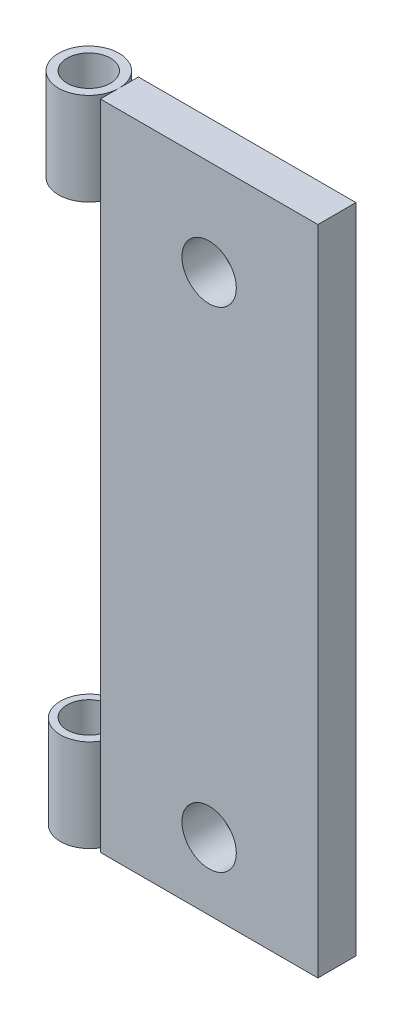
ISO-10303-21;
HEADER;
FILE_DESCRIPTION(('STEP AP214'),'2;1');
FILE_NAME('part.step','',(''),(''),'','','');
FILE_SCHEMA(('AUTOMOTIVE_DESIGN { 1 0 10303 214 1 1 1 1 }'));
ENDSEC;
DATA;
#1=APPLICATION_CONTEXT('core data for automotive mechanical design processes');
#2=APPLICATION_PROTOCOL_DEFINITION('international standard','automotive_design',2000,#1);
#3=PRODUCT_CONTEXT('',#1,'mechanical');
#4=PRODUCT('Part','Part','',(#3));
#5=PRODUCT_RELATED_PRODUCT_CATEGORY('part','',(#4));
#6=PRODUCT_DEFINITION_FORMATION('','',#4);
#7=PRODUCT_DEFINITION_CONTEXT('part definition',#1,'design');
#8=PRODUCT_DEFINITION('design','',#6,#7);
#9=PRODUCT_DEFINITION_SHAPE('','',#8);
#10=(LENGTH_UNIT() NAMED_UNIT(*) SI_UNIT(.MILLI.,.METRE.));
#11=(NAMED_UNIT(*) PLANE_ANGLE_UNIT() SI_UNIT($,.RADIAN.));
#12=(NAMED_UNIT(*) SI_UNIT($,.STERADIAN.) SOLID_ANGLE_UNIT());
#13=UNCERTAINTY_MEASURE_WITH_UNIT(LENGTH_MEASURE(1.E-05),#10,'distance_accuracy_value','');
#14=(GEOMETRIC_REPRESENTATION_CONTEXT(3) GLOBAL_UNCERTAINTY_ASSIGNED_CONTEXT((#13)) GLOBAL_UNIT_ASSIGNED_CONTEXT((#10,
#11,#12)) REPRESENTATION_CONTEXT('',''));
#15=CARTESIAN_POINT('',(0.,0.,0.));
#16=DIRECTION('',(0.,0.,1.));
#17=DIRECTION('',(1.,0.,0.));
#18=AXIS2_PLACEMENT_3D('',#15,#16,#17);
#19=CARTESIAN_POINT('',(-25.3853328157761,-43.,3.56421296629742));
#20=DIRECTION('',(0.,-1.,0.));
#21=DIRECTION('',(0.,0.,-1.));
#22=AXIS2_PLACEMENT_3D('',#19,#20,#21);
#23=CYLINDRICAL_SURFACE('',#22,5.38533281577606);
#24=CARTESIAN_POINT('',(-25.3853328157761,-43.,3.56421296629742));
#25=DIRECTION('',(0.,-1.,0.));
#26=DIRECTION('',(0.,0.,-1.));
#27=AXIS2_PLACEMENT_3D('',#24,#25,#26);
#28=CIRCLE('',#27,5.38533281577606);
#29=CARTESIAN_POINT('',(-25.3853328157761,-43.,-1.82111984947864));
#30=VERTEX_POINT('',#29);
#31=EDGE_CURVE('E11',#30,#30,#28,.T.);
#32=ORIENTED_EDGE('',*,*,#31,.T.);
#33=EDGE_LOOP('',(#32));
#34=FACE_BOUND('',#33,.T.);
#35=CARTESIAN_POINT('',(-25.3853328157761,-60.,3.56421296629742));
#36=DIRECTION('',(0.,-1.,0.));
#37=DIRECTION('',(0.,0.,-1.));
#38=AXIS2_PLACEMENT_3D('',#35,#36,#37);
#39=CIRCLE('',#38,5.38533281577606);
#40=CARTESIAN_POINT('',(-25.3853328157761,-60.,-1.82111984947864));
#41=VERTEX_POINT('',#40);
#42=EDGE_CURVE('E43',#41,#41,#39,.T.);
#43=ORIENTED_EDGE('',*,*,#42,.F.);
#44=EDGE_LOOP('',(#43));
#45=FACE_BOUND('',#44,.T.);
#46=ADVANCED_FACE('F40',(#34,#45),#23,.T.);
#47=CARTESIAN_POINT('',(-25.3853328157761,-43.,3.56421296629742));
#48=DIRECTION('',(0.,-1.,0.));
#49=DIRECTION('',(0.,0.,-1.));
#50=AXIS2_PLACEMENT_3D('',#47,#48,#49);
#51=PLANE('',#50);
#52=CARTESIAN_POINT('',(-25.5621825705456,-43.,3.56421296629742));
#53=DIRECTION('',(0.,1.,0.));
#54=DIRECTION('',(0.,0.,1.));
#55=AXIS2_PLACEMENT_3D('',#52,#53,#54);
#56=CIRCLE('',#55,4.00000000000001);
#57=CARTESIAN_POINT('',(-25.5621825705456,-43.,7.56421296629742));
#58=VERTEX_POINT('',#57);
#59=EDGE_CURVE('E52',#58,#58,#56,.T.);
#60=ORIENTED_EDGE('',*,*,#59,.F.);
#61=EDGE_LOOP('',(#60));
#62=FACE_BOUND('',#61,.T.);
#63=ORIENTED_EDGE('',*,*,#31,.F.);
#64=EDGE_LOOP('',(#63));
#65=FACE_BOUND('',#64,.T.);
#66=ADVANCED_FACE('F67',(#62,#65),#51,.F.);
#67=CARTESIAN_POINT('',(-25.3853328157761,-60.,3.56421296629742));
#68=DIRECTION('',(0.,-1.,0.));
#69=DIRECTION('',(0.,0.,-1.));
#70=AXIS2_PLACEMENT_3D('',#67,#68,#69);
#71=PLANE('',#70);
#72=CARTESIAN_POINT('',(-25.5621825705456,-60.,3.56421296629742));
#73=DIRECTION('',(0.,1.,0.));
#74=DIRECTION('',(0.,0.,1.));
#75=AXIS2_PLACEMENT_3D('',#72,#73,#74);
#76=CIRCLE('',#75,4.00000000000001);
#77=CARTESIAN_POINT('',(-25.5621825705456,-60.,7.56421296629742));
#78=VERTEX_POINT('',#77);
#79=EDGE_CURVE('E50',#78,#78,#76,.T.);
#80=ORIENTED_EDGE('',*,*,#79,.T.);
#81=EDGE_LOOP('',(#80));
#82=FACE_BOUND('',#81,.T.);
#83=ORIENTED_EDGE('',*,*,#42,.T.);
#84=EDGE_LOOP('',(#83));
#85=FACE_BOUND('',#84,.T.);
#86=ADVANCED_FACE('F58',(#82,#85),#71,.T.);
#87=CARTESIAN_POINT('',(-25.5621825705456,-60.,3.56421296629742));
#88=DIRECTION('',(0.,1.,0.));
#89=DIRECTION('',(0.,0.,1.));
#90=AXIS2_PLACEMENT_3D('',#87,#88,#89);
#91=CYLINDRICAL_SURFACE('',#90,4.00000000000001);
#92=ORIENTED_EDGE('',*,*,#79,.F.);
#93=EDGE_LOOP('',(#92));
#94=FACE_BOUND('',#93,.T.);
#95=ORIENTED_EDGE('',*,*,#59,.T.);
#96=EDGE_LOOP('',(#95));
#97=FACE_BOUND('',#96,.T.);
#98=ADVANCED_FACE('F61',(#94,#97),#91,.F.);
#99=CLOSED_SHELL('',(#46,#66,#86,#98));
#100=MANIFOLD_SOLID_BREP('B2',#99);
#101=CARTESIAN_POINT('',(-25.5621825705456,43.,3.56421296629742));
#102=DIRECTION('',(0.,1.,0.));
#103=DIRECTION('',(0.,0.,1.));
#104=AXIS2_PLACEMENT_3D('',#101,#102,#103);
#105=CYLINDRICAL_SURFACE('',#104,5.56218257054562);
#106=CARTESIAN_POINT('',(-25.5621825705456,43.,3.56421296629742));
#107=DIRECTION('',(0.,1.,0.));
#108=DIRECTION('',(0.,0.,1.));
#109=AXIS2_PLACEMENT_3D('',#106,#107,#108);
#110=CIRCLE('',#109,5.56218257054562);
#111=CARTESIAN_POINT('',(-25.5621825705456,43.,9.12639553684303));
#112=VERTEX_POINT('',#111);
#113=EDGE_CURVE('E39',#112,#112,#110,.T.);
#114=ORIENTED_EDGE('',*,*,#113,.T.);
#115=EDGE_LOOP('',(#114));
#116=FACE_BOUND('',#115,.T.);
#117=CARTESIAN_POINT('',(-25.5621825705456,60.,3.56421296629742));
#118=DIRECTION('',(0.,1.,0.));
#119=DIRECTION('',(0.,0.,1.));
#120=AXIS2_PLACEMENT_3D('',#117,#118,#119);
#121=CIRCLE('',#120,5.56218257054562);
#122=CARTESIAN_POINT('',(-25.5621825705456,60.,9.12639553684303));
#123=VERTEX_POINT('',#122);
#124=EDGE_CURVE('E114',#123,#123,#121,.T.);
#125=ORIENTED_EDGE('',*,*,#124,.F.);
#126=EDGE_LOOP('',(#125));
#127=FACE_BOUND('',#126,.T.);
#128=ADVANCED_FACE('F111',(#116,#127),#105,.T.);
#129=CARTESIAN_POINT('',(-25.5621825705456,43.,3.56421296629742));
#130=DIRECTION('',(0.,1.,0.));
#131=DIRECTION('',(0.,0.,1.));
#132=AXIS2_PLACEMENT_3D('',#129,#130,#131);
#133=PLANE('',#132);
#134=CARTESIAN_POINT('',(-25.5621825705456,43.,3.56421296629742));
#135=DIRECTION('',(0.,-1.,0.));
#136=DIRECTION('',(0.,0.,-1.));
#137=AXIS2_PLACEMENT_3D('',#134,#135,#136);
#138=CIRCLE('',#137,4.00000000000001);
#139=CARTESIAN_POINT('',(-25.5621825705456,43.,-0.43578703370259));
#140=VERTEX_POINT('',#139);
#141=EDGE_CURVE('E123',#140,#140,#138,.T.);
#142=ORIENTED_EDGE('',*,*,#141,.F.);
#143=EDGE_LOOP('',(#142));
#144=FACE_BOUND('',#143,.T.);
#145=ORIENTED_EDGE('',*,*,#113,.F.);
#146=EDGE_LOOP('',(#145));
#147=FACE_BOUND('',#146,.T.);
#148=ADVANCED_FACE('F138',(#144,#147),#133,.F.);
#149=CARTESIAN_POINT('',(-25.5621825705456,60.,3.56421296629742));
#150=DIRECTION('',(0.,1.,0.));
#151=DIRECTION('',(0.,0.,1.));
#152=AXIS2_PLACEMENT_3D('',#149,#150,#151);
#153=PLANE('',#152);
#154=CARTESIAN_POINT('',(-25.5621825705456,60.,3.56421296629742));
#155=DIRECTION('',(0.,-1.,0.));
#156=DIRECTION('',(0.,0.,-1.));
#157=AXIS2_PLACEMENT_3D('',#154,#155,#156);
#158=CIRCLE('',#157,4.00000000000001);
#159=CARTESIAN_POINT('',(-25.5621825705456,60.,-0.43578703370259));
#160=VERTEX_POINT('',#159);
#161=EDGE_CURVE('E121',#160,#160,#158,.T.);
#162=ORIENTED_EDGE('',*,*,#161,.T.);
#163=EDGE_LOOP('',(#162));
#164=FACE_BOUND('',#163,.T.);
#165=ORIENTED_EDGE('',*,*,#124,.T.);
#166=EDGE_LOOP('',(#165));
#167=FACE_BOUND('',#166,.T.);
#168=ADVANCED_FACE('F129',(#164,#167),#153,.T.);
#169=CARTESIAN_POINT('',(-25.5621825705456,60.,3.56421296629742));
#170=DIRECTION('',(0.,-1.,0.));
#171=DIRECTION('',(0.,0.,-1.));
#172=AXIS2_PLACEMENT_3D('',#169,#170,#171);
#173=CYLINDRICAL_SURFACE('',#172,4.00000000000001);
#174=ORIENTED_EDGE('',*,*,#161,.F.);
#175=EDGE_LOOP('',(#174));
#176=FACE_BOUND('',#175,.T.);
#177=ORIENTED_EDGE('',*,*,#141,.T.);
#178=EDGE_LOOP('',(#177));
#179=FACE_BOUND('',#178,.T.);
#180=ADVANCED_FACE('F132',(#176,#179),#173,.F.);
#181=CLOSED_SHELL('',(#128,#148,#168,#180));
#182=MANIFOLD_SOLID_BREP('B6',#181);
#183=CARTESIAN_POINT('',(20.,60.,7.));
#184=DIRECTION('',(-1.,0.,0.));
#185=DIRECTION('',(0.,-1.,0.));
#186=AXIS2_PLACEMENT_3D('',#183,#184,#185);
#187=PLANE('',#186);
#188=DIRECTION('',(0.,1.,0.));
#189=VECTOR('',#188,1.);
#190=CARTESIAN_POINT('',(20.,60.,0.));
#191=LINE('',#190,#189);
#192=CARTESIAN_POINT('',(20.,-60.,0.));
#193=VERTEX_POINT('',#192);
#194=CARTESIAN_POINT('',(20.,60.,0.));
#195=VERTEX_POINT('',#194);
#196=EDGE_CURVE('E239',#193,#195,#191,.T.);
#197=ORIENTED_EDGE('',*,*,#196,.T.);
#198=DIRECTION('',(0.,0.,-1.));
#199=VECTOR('',#198,1.);
#200=CARTESIAN_POINT('',(20.,60.,7.));
#201=LINE('',#200,#199);
#202=CARTESIAN_POINT('',(20.,60.,7.));
#203=VERTEX_POINT('',#202);
#204=EDGE_CURVE('E109',#203,#195,#201,.T.);
#205=ORIENTED_EDGE('',*,*,#204,.F.);
#206=DIRECTION('',(0.,1.,0.));
#207=VECTOR('',#206,1.);
#208=CARTESIAN_POINT('',(20.,60.,7.));
#209=LINE('',#208,#207);
#210=CARTESIAN_POINT('',(20.,-60.,7.));
#211=VERTEX_POINT('',#210);
#212=EDGE_CURVE('E226',#211,#203,#209,.T.);
#213=ORIENTED_EDGE('',*,*,#212,.F.);
#214=DIRECTION('',(0.,0.,-1.));
#215=VECTOR('',#214,1.);
#216=CARTESIAN_POINT('',(20.,-60.,7.));
#217=LINE('',#216,#215);
#218=EDGE_CURVE('E235',#211,#193,#217,.T.);
#219=ORIENTED_EDGE('',*,*,#218,.T.);
#220=EDGE_LOOP('',(#197,#205,#213,#219));
#221=FACE_BOUND('',#220,.T.);
#222=ADVANCED_FACE('F173',(#221),#187,.F.);
#223=CARTESIAN_POINT('',(-20.,60.,7.));
#224=DIRECTION('',(0.,-1.,0.));
#225=DIRECTION('',(0.,0.,-1.));
#226=AXIS2_PLACEMENT_3D('',#223,#224,#225);
#227=PLANE('',#226);
#228=DIRECTION('',(-1.,0.,0.));
#229=VECTOR('',#228,1.);
#230=CARTESIAN_POINT('',(-20.,60.,0.));
#231=LINE('',#230,#229);
#232=CARTESIAN_POINT('',(-20.,60.,0.));
#233=VERTEX_POINT('',#232);
#234=EDGE_CURVE('E230',#195,#233,#231,.T.);
#235=ORIENTED_EDGE('',*,*,#234,.T.);
#236=DIRECTION('',(0.,0.,-1.));
#237=VECTOR('',#236,1.);
#238=CARTESIAN_POINT('',(-20.,60.,7.));
#239=LINE('',#238,#237);
#240=CARTESIAN_POINT('',(-20.,60.,7.));
#241=VERTEX_POINT('',#240);
#242=EDGE_CURVE('E182',#241,#233,#239,.T.);
#243=ORIENTED_EDGE('',*,*,#242,.F.);
#244=DIRECTION('',(-1.,0.,0.));
#245=VECTOR('',#244,1.);
#246=CARTESIAN_POINT('',(-20.,60.,7.));
#247=LINE('',#246,#245);
#248=EDGE_CURVE('E221',#203,#241,#247,.T.);
#249=ORIENTED_EDGE('',*,*,#248,.F.);
#250=ORIENTED_EDGE('',*,*,#204,.T.);
#251=EDGE_LOOP('',(#235,#243,#249,#250));
#252=FACE_BOUND('',#251,.T.);
#253=ADVANCED_FACE('F229',(#252),#227,.F.);
#254=CARTESIAN_POINT('',(-20.,60.,7.));
#255=DIRECTION('',(1.,0.,0.));
#256=DIRECTION('',(0.,1.,0.));
#257=AXIS2_PLACEMENT_3D('',#254,#255,#256);
#258=PLANE('',#257);
#259=DIRECTION('',(0.,-1.,0.));
#260=VECTOR('',#259,1.);
#261=CARTESIAN_POINT('',(-20.,60.,0.));
#262=LINE('',#261,#260);
#263=CARTESIAN_POINT('',(-20.,-60.,0.));
#264=VERTEX_POINT('',#263);
#265=EDGE_CURVE('E208',#233,#264,#262,.T.);
#266=ORIENTED_EDGE('',*,*,#265,.T.);
#267=DIRECTION('',(0.,0.,-1.));
#268=VECTOR('',#267,1.);
#269=CARTESIAN_POINT('',(-20.,-60.,7.));
#270=LINE('',#269,#268);
#271=CARTESIAN_POINT('',(-20.,-60.,7.));
#272=VERTEX_POINT('',#271);
#273=EDGE_CURVE('E231',#272,#264,#270,.T.);
#274=ORIENTED_EDGE('',*,*,#273,.F.);
#275=DIRECTION('',(0.,-1.,0.));
#276=VECTOR('',#275,1.);
#277=CARTESIAN_POINT('',(-20.,60.,7.));
#278=LINE('',#277,#276);
#279=EDGE_CURVE('E224',#241,#272,#278,.T.);
#280=ORIENTED_EDGE('',*,*,#279,.F.);
#281=ORIENTED_EDGE('',*,*,#242,.T.);
#282=EDGE_LOOP('',(#266,#274,#280,#281));
#283=FACE_BOUND('',#282,.T.);
#284=ADVANCED_FACE('F233',(#283),#258,.F.);
#285=CARTESIAN_POINT('',(-20.,-60.,7.));
#286=DIRECTION('',(0.,1.,0.));
#287=DIRECTION('',(0.,0.,1.));
#288=AXIS2_PLACEMENT_3D('',#285,#286,#287);
#289=PLANE('',#288);
#290=DIRECTION('',(1.,0.,0.));
#291=VECTOR('',#290,1.);
#292=CARTESIAN_POINT('',(-20.,-60.,0.));
#293=LINE('',#292,#291);
#294=EDGE_CURVE('E214',#264,#193,#293,.T.);
#295=ORIENTED_EDGE('',*,*,#294,.T.);
#296=ORIENTED_EDGE('',*,*,#218,.F.);
#297=DIRECTION('',(1.,0.,0.));
#298=VECTOR('',#297,1.);
#299=CARTESIAN_POINT('',(-20.,-60.,7.));
#300=LINE('',#299,#298);
#301=EDGE_CURVE('E191',#272,#211,#300,.T.);
#302=ORIENTED_EDGE('',*,*,#301,.F.);
#303=ORIENTED_EDGE('',*,*,#273,.T.);
#304=EDGE_LOOP('',(#295,#296,#302,#303));
#305=FACE_BOUND('',#304,.T.);
#306=ADVANCED_FACE('F266',(#305),#289,.F.);
#307=CARTESIAN_POINT('',(0.,0.,7.));
#308=DIRECTION('',(0.,0.,1.));
#309=DIRECTION('',(1.,0.,0.));
#310=AXIS2_PLACEMENT_3D('',#307,#308,#309);
#311=PLANE('',#310);
#312=CARTESIAN_POINT('',(0.,42.381921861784,7.));
#313=DIRECTION('',(0.,0.,1.));
#314=DIRECTION('',(1.,0.,0.));
#315=AXIS2_PLACEMENT_3D('',#312,#313,#314);
#316=CIRCLE('',#315,5.);
#317=CARTESIAN_POINT('',(5.,42.381921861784,7.));
#318=VERTEX_POINT('',#317);
#319=EDGE_CURVE('E248',#318,#318,#316,.T.);
#320=ORIENTED_EDGE('',*,*,#319,.F.);
#321=EDGE_LOOP('',(#320));
#322=FACE_BOUND('',#321,.T.);
#323=CARTESIAN_POINT('',(0.,-47.618078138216,7.));
#324=DIRECTION('',(0.,0.,1.));
#325=DIRECTION('',(1.,0.,0.));
#326=AXIS2_PLACEMENT_3D('',#323,#324,#325);
#327=CIRCLE('',#326,5.);
#328=CARTESIAN_POINT('',(5.,-47.618078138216,7.));
#329=VERTEX_POINT('',#328);
#330=EDGE_CURVE('E253',#329,#329,#327,.T.);
#331=ORIENTED_EDGE('',*,*,#330,.F.);
#332=EDGE_LOOP('',(#331));
#333=FACE_BOUND('',#332,.T.);
#334=ORIENTED_EDGE('',*,*,#212,.T.);
#335=ORIENTED_EDGE('',*,*,#248,.T.);
#336=ORIENTED_EDGE('',*,*,#279,.T.);
#337=ORIENTED_EDGE('',*,*,#301,.T.);
#338=EDGE_LOOP('',(#334,#335,#336,#337));
#339=FACE_BOUND('',#338,.T.);
#340=ADVANCED_FACE('F222',(#322,#333,#339),#311,.T.);
#341=CARTESIAN_POINT('',(0.,0.,0.));
#342=DIRECTION('',(0.,0.,1.));
#343=DIRECTION('',(1.,0.,0.));
#344=AXIS2_PLACEMENT_3D('',#341,#342,#343);
#345=PLANE('',#344);
#346=CARTESIAN_POINT('',(0.,42.381921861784,0.));
#347=DIRECTION('',(0.,0.,1.));
#348=DIRECTION('',(1.,0.,0.));
#349=AXIS2_PLACEMENT_3D('',#346,#347,#348);
#350=CIRCLE('',#349,5.);
#351=CARTESIAN_POINT('',(5.,42.381921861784,0.));
#352=VERTEX_POINT('',#351);
#353=EDGE_CURVE('E176',#352,#352,#350,.T.);
#354=ORIENTED_EDGE('',*,*,#353,.T.);
#355=EDGE_LOOP('',(#354));
#356=FACE_BOUND('',#355,.T.);
#357=CARTESIAN_POINT('',(0.,-47.618078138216,0.));
#358=DIRECTION('',(0.,0.,1.));
#359=DIRECTION('',(1.,0.,0.));
#360=AXIS2_PLACEMENT_3D('',#357,#358,#359);
#361=CIRCLE('',#360,5.);
#362=CARTESIAN_POINT('',(5.,-47.618078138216,0.));
#363=VERTEX_POINT('',#362);
#364=EDGE_CURVE('E246',#363,#363,#361,.T.);
#365=ORIENTED_EDGE('',*,*,#364,.T.);
#366=EDGE_LOOP('',(#365));
#367=FACE_BOUND('',#366,.T.);
#368=ORIENTED_EDGE('',*,*,#196,.F.);
#369=ORIENTED_EDGE('',*,*,#294,.F.);
#370=ORIENTED_EDGE('',*,*,#265,.F.);
#371=ORIENTED_EDGE('',*,*,#234,.F.);
#372=EDGE_LOOP('',(#368,#369,#370,#371));
#373=FACE_BOUND('',#372,.T.);
#374=ADVANCED_FACE('F265',(#356,#367,#373),#345,.F.);
#375=CARTESIAN_POINT('',(0.,-47.618078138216,-1.9979696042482));
#376=DIRECTION('',(0.,0.,1.));
#377=DIRECTION('',(1.,0.,0.));
#378=AXIS2_PLACEMENT_3D('',#375,#376,#377);
#379=CYLINDRICAL_SURFACE('',#378,5.);
#380=ORIENTED_EDGE('',*,*,#330,.T.);
#381=EDGE_LOOP('',(#380));
#382=FACE_BOUND('',#381,.T.);
#383=ORIENTED_EDGE('',*,*,#364,.F.);
#384=EDGE_LOOP('',(#383));
#385=FACE_BOUND('',#384,.T.);
#386=ADVANCED_FACE('F261',(#382,#385),#379,.F.);
#387=CARTESIAN_POINT('',(0.,42.381921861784,-1.9979696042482));
#388=DIRECTION('',(0.,0.,1.));
#389=DIRECTION('',(1.,0.,0.));
#390=AXIS2_PLACEMENT_3D('',#387,#388,#389);
#391=CYLINDRICAL_SURFACE('',#390,5.);
#392=ORIENTED_EDGE('',*,*,#319,.T.);
#393=EDGE_LOOP('',(#392));
#394=FACE_BOUND('',#393,.T.);
#395=ORIENTED_EDGE('',*,*,#353,.F.);
#396=EDGE_LOOP('',(#395));
#397=FACE_BOUND('',#396,.T.);
#398=ADVANCED_FACE('F313',(#394,#397),#391,.F.);
#399=CLOSED_SHELL('',(#222,#253,#284,#306,#340,#374,#386,#398));
#400=MANIFOLD_SOLID_BREP('B34',#399);
#401=ADVANCED_BREP_SHAPE_REPRESENTATION('',(#18,#100,#182,#400),#14);
#402=SHAPE_DEFINITION_REPRESENTATION(#9,#401);
ENDSEC;
END-ISO-10303-21;
